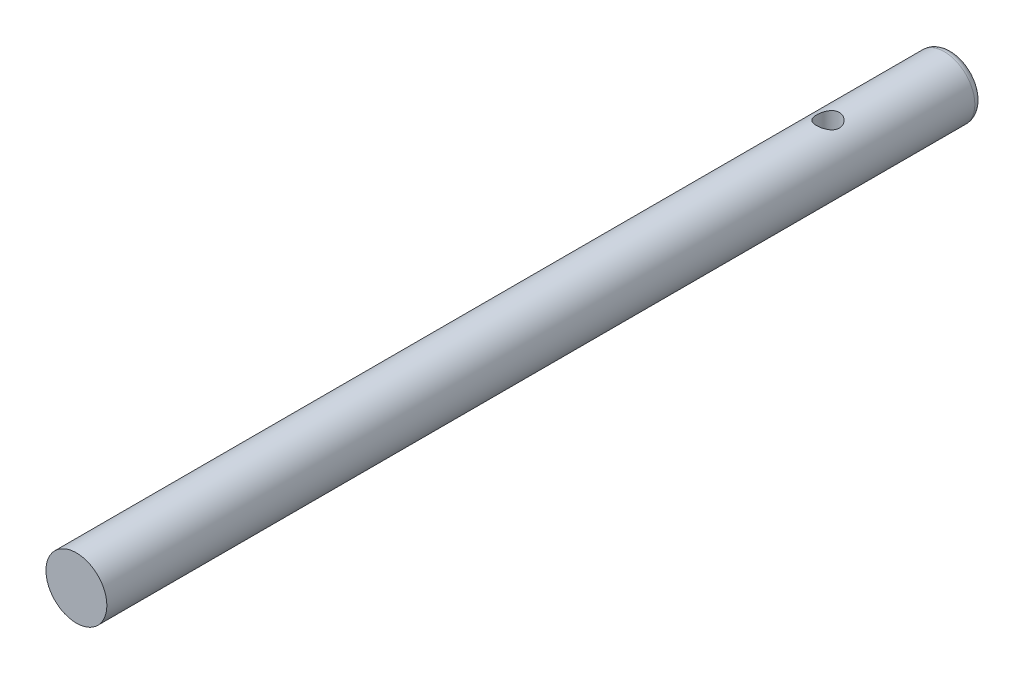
ISO-10303-21;
HEADER;
FILE_DESCRIPTION(('STEP AP214'),'2;1');
FILE_NAME('part.step','',(''),(''),'','','');
FILE_SCHEMA(('AUTOMOTIVE_DESIGN { 1 0 10303 214 1 1 1 1 }'));
ENDSEC;
DATA;
#1=APPLICATION_CONTEXT('core data for automotive mechanical design processes');
#2=APPLICATION_PROTOCOL_DEFINITION('international standard','automotive_design',2000,#1);
#3=PRODUCT_CONTEXT('',#1,'mechanical');
#4=PRODUCT('Part','Part','',(#3));
#5=PRODUCT_RELATED_PRODUCT_CATEGORY('part','',(#4));
#6=PRODUCT_DEFINITION_FORMATION('','',#4);
#7=PRODUCT_DEFINITION_CONTEXT('part definition',#1,'design');
#8=PRODUCT_DEFINITION('design','',#6,#7);
#9=PRODUCT_DEFINITION_SHAPE('','',#8);
#10=(LENGTH_UNIT() NAMED_UNIT(*) SI_UNIT(.MILLI.,.METRE.));
#11=(NAMED_UNIT(*) PLANE_ANGLE_UNIT() SI_UNIT($,.RADIAN.));
#12=(NAMED_UNIT(*) SI_UNIT($,.STERADIAN.) SOLID_ANGLE_UNIT());
#13=UNCERTAINTY_MEASURE_WITH_UNIT(LENGTH_MEASURE(1.E-05),#10,'distance_accuracy_value','');
#14=(GEOMETRIC_REPRESENTATION_CONTEXT(3) GLOBAL_UNCERTAINTY_ASSIGNED_CONTEXT((#13)) GLOBAL_UNIT_ASSIGNED_CONTEXT((#10,
#11,#12)) REPRESENTATION_CONTEXT('',''));
#15=CARTESIAN_POINT('',(0.,0.,0.));
#16=DIRECTION('',(0.,0.,1.));
#17=DIRECTION('',(1.,0.,0.));
#18=AXIS2_PLACEMENT_3D('',#15,#16,#17);
#19=CARTESIAN_POINT('',(0.,0.,115.));
#20=DIRECTION('',(0.,0.,-1.));
#21=DIRECTION('',(-1.,0.,0.));
#22=AXIS2_PLACEMENT_3D('',#19,#20,#21);
#23=CYLINDRICAL_SURFACE('',#22,4.);
#24=CARTESIAN_POINT('',(0.,0.,1.));
#25=DIRECTION('',(0.,0.,1.));
#26=DIRECTION('',(1.,0.,0.));
#27=AXIS2_PLACEMENT_3D('',#24,#25,#26);
#28=CIRCLE('',#27,4.);
#29=CARTESIAN_POINT('',(4.,0.,1.));
#30=VERTEX_POINT('',#29);
#31=EDGE_CURVE('E56',#30,#30,#28,.T.);
#32=ORIENTED_EDGE('',*,*,#31,.T.);
#33=EDGE_LOOP('',(#32));
#34=FACE_BOUND('',#33,.T.);
#35=CARTESIAN_POINT('',(0.,0.,115.));
#36=DIRECTION('',(0.,0.,1.));
#37=DIRECTION('',(1.,0.,0.));
#38=AXIS2_PLACEMENT_3D('',#35,#36,#37);
#39=CIRCLE('',#38,4.);
#40=CARTESIAN_POINT('',(4.,0.,115.));
#41=VERTEX_POINT('',#40);
#42=EDGE_CURVE('E62',#41,#41,#39,.T.);
#43=ORIENTED_EDGE('',*,*,#42,.F.);
#44=EDGE_LOOP('',(#43));
#45=FACE_BOUND('',#44,.T.);
#46=CARTESIAN_POINT('',(0.,-4.,14.8));
#47=CARTESIAN_POINT('',(0.0812350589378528,-4.00000217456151,14.7999970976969));
#48=CARTESIAN_POINT('',(0.162450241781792,-3.99750379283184,14.8066197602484));
#49=CARTESIAN_POINT('',(0.322453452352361,-3.98778696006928,14.8328281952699));
#50=CARTESIAN_POINT('',(0.401241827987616,-3.98056918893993,14.8524121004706));
#51=CARTESIAN_POINT('',(0.554060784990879,-3.96218832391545,14.9037530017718));
#52=CARTESIAN_POINT('',(0.628100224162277,-3.9510328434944,14.9354865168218));
#53=CARTESIAN_POINT('',(0.769799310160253,-3.92588767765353,15.0101064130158));
#54=CARTESIAN_POINT('',(0.837457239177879,-3.91189723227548,15.0529957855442));
#55=CARTESIAN_POINT('',(0.967346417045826,-3.88186246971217,15.1506125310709));
#56=CARTESIAN_POINT('',(1.02927073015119,-3.86576002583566,15.2057302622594));
#57=CARTESIAN_POINT('',(1.14324421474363,-3.83360220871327,15.3254104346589));
#58=CARTESIAN_POINT('',(1.19529036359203,-3.81754685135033,15.3899757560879));
#59=CARTESIAN_POINT('',(1.28998202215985,-3.78662470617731,15.5297174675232));
#60=CARTESIAN_POINT('',(1.3321939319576,-3.77182648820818,15.6052043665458));
#61=CARTESIAN_POINT('',(1.40318646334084,-3.74599860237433,15.7628483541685));
#62=CARTESIAN_POINT('',(1.43197244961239,-3.73496742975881,15.8450027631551));
#63=CARTESIAN_POINT('',(1.47408431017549,-3.71854412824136,16.0101167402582));
#64=CARTESIAN_POINT('',(1.48799593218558,-3.71293924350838,16.0929050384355));
#65=CARTESIAN_POINT('',(1.50179556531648,-3.70738061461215,16.2598161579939));
#66=CARTESIAN_POINT('',(1.50168936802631,-3.70742453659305,16.3439384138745));
#67=CARTESIAN_POINT('',(1.48790429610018,-3.71297511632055,16.505769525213));
#68=CARTESIAN_POINT('',(1.47503808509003,-3.71815468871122,16.5835609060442));
#69=CARTESIAN_POINT('',(1.4374416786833,-3.73284938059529,16.7357871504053));
#70=CARTESIAN_POINT('',(1.41270969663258,-3.74236515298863,16.8102215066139));
#71=CARTESIAN_POINT('',(1.35163748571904,-3.76485702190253,16.9552770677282));
#72=CARTESIAN_POINT('',(1.31508648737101,-3.77789517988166,17.0257994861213));
#73=CARTESIAN_POINT('',(1.23156073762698,-3.80594210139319,17.159945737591));
#74=CARTESIAN_POINT('',(1.18458238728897,-3.82095154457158,17.2235671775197));
#75=CARTESIAN_POINT('',(1.07781780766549,-3.85248038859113,17.3466036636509));
#76=CARTESIAN_POINT('',(1.01738298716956,-3.86903347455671,17.4054486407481));
#77=CARTESIAN_POINT('',(0.887312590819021,-3.90091728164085,17.5123379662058));
#78=CARTESIAN_POINT('',(0.817675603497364,-3.91624781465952,17.5603806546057));
#79=CARTESIAN_POINT('',(0.669723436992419,-3.9442639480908,17.6449303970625));
#80=CARTESIAN_POINT('',(0.591290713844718,-3.95690498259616,17.6812475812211));
#81=CARTESIAN_POINT('',(0.428836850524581,-3.97778718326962,17.73998260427));
#82=CARTESIAN_POINT('',(0.344818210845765,-3.98603030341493,17.7624066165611));
#83=CARTESIAN_POINT('',(0.178375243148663,-3.99684443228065,17.791622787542));
#84=CARTESIAN_POINT('',(0.0961036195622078,-3.99969369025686,17.7991826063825));
#85=CARTESIAN_POINT('',(-0.0685724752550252,-4.00025893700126,17.8006910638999));
#86=CARTESIAN_POINT('',(-0.150976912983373,-3.99797606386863,17.7946427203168));
#87=CARTESIAN_POINT('',(-0.31026204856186,-3.98871709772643,17.7696899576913));
#88=CARTESIAN_POINT('',(-0.387233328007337,-3.98192470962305,17.7512884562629));
#89=CARTESIAN_POINT('',(-0.536941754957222,-3.96451477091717,17.7028139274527));
#90=CARTESIAN_POINT('',(-0.609678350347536,-3.9538967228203,17.672739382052));
#91=CARTESIAN_POINT('',(-0.751247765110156,-3.92949624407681,17.6008135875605));
#92=CARTESIAN_POINT('',(-0.819903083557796,-3.91563000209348,17.5586422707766));
#93=CARTESIAN_POINT('',(-0.949392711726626,-3.88626671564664,17.4640818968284));
#94=CARTESIAN_POINT('',(-1.01022412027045,-3.87076907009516,17.4116890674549));
#95=CARTESIAN_POINT('',(-1.12603079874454,-3.83873329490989,17.2945958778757));
#96=CARTESIAN_POINT('',(-1.18046154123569,-3.82218696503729,17.2293578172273));
#97=CARTESIAN_POINT('',(-1.27771050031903,-3.79078815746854,17.0903486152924));
#98=CARTESIAN_POINT('',(-1.32052767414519,-3.77593583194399,17.0165767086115));
#99=CARTESIAN_POINT('',(-1.39337773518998,-3.74966829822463,16.8619840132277));
#100=CARTESIAN_POINT('',(-1.42335685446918,-3.73826760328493,16.7811352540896));
#101=CARTESIAN_POINT('',(-1.46907883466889,-3.72054032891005,16.6149902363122));
#102=CARTESIAN_POINT('',(-1.48483050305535,-3.71421061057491,16.5296967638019));
#103=CARTESIAN_POINT('',(-1.50086347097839,-3.70775894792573,16.3629838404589));
#104=CARTESIAN_POINT('',(-1.50207331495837,-3.70726444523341,16.2816673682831));
#105=CARTESIAN_POINT('',(-1.49136715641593,-3.71158412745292,16.1200546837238));
#106=CARTESIAN_POINT('',(-1.47945239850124,-3.71639780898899,16.0397583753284));
#107=CARTESIAN_POINT('',(-1.44355815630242,-3.73048141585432,15.8849527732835));
#108=CARTESIAN_POINT('',(-1.41995798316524,-3.73961085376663,15.8103416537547));
#109=CARTESIAN_POINT('',(-1.3616969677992,-3.76121548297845,15.6660944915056));
#110=CARTESIAN_POINT('',(-1.32703332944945,-3.77369151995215,15.5964597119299));
#111=CARTESIAN_POINT('',(-1.24552075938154,-3.80139723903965,15.4601732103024));
#112=CARTESIAN_POINT('',(-1.1981283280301,-3.81673698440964,15.3938692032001));
#113=CARTESIAN_POINT('',(-1.09334485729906,-3.84806246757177,15.2698584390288));
#114=CARTESIAN_POINT('',(-1.03595064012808,-3.86404840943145,15.2121544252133));
#115=CARTESIAN_POINT('',(-0.909080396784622,-3.89590424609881,15.1037980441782));
#116=CARTESIAN_POINT('',(-0.839118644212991,-3.91172104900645,15.0536962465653));
#117=CARTESIAN_POINT('',(-0.69121322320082,-3.94054514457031,14.9659773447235));
#118=CARTESIAN_POINT('',(-0.613268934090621,-3.95355221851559,14.9283612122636));
#119=CARTESIAN_POINT('',(-0.447999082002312,-3.9757429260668,14.8656231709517));
#120=CARTESIAN_POINT('',(-0.360413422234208,-3.98473657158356,14.8411129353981));
#121=CARTESIAN_POINT('',(-0.181875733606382,-3.99686242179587,14.8083070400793));
#122=CARTESIAN_POINT('',(-0.0909254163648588,-3.99999756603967,14.8000032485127));
#123=CARTESIAN_POINT('',(0.,-4.,14.8));
#124=B_SPLINE_CURVE_WITH_KNOTS('',3,(#46,#47,#48,#49,#50,#51,#52,#53,#54,#55,#56,#57,#58,#59,
#60,#61,#62,#63,#64,#65,#66,#67,#68,#69,#70,#71,#72,#73,#74,#75,#76,#77,#78,#79,#80,#81,#82,#83,
#84,#85,#86,#87,#88,#89,#90,#91,#92,#93,#94,#95,#96,#97,#98,#99,#100,#101,#102,#103,#104,#105,
#106,#107,#108,#109,#110,#111,#112,#113,#114,#115,#116,#117,#118,#119,#120,#121,#122,#123),
.UNSPECIFIED.,.T.,.F.,(4,2,2,2,2,2,2,2,2,2,2,2,2,2,2,2,2,2,2,2,2,2,2,2,2,2,2,2,2,2,2,2,2,2,2,2,
2,2,4),(0.,0.24336980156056,0.48670454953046,0.729571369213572,0.97250337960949,
1.22473618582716,1.47704604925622,1.73896674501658,2.00078269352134,2.25185874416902,
2.50283106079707,2.73878345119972,2.97477138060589,3.21522408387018,3.45575990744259,
3.71246153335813,3.96920257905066,4.22991375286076,4.49050899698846,4.73725019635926,
4.98393668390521,5.2211443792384,5.45838293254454,5.702592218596,5.94689180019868,
6.20536519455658,6.46386178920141,6.72343066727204,6.98283874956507,7.22558763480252,
7.46831350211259,7.70363142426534,7.93900886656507,8.18672471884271,8.43451941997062,
8.69572329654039,8.95694749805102,9.22948515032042,9.50188601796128),.UNSPECIFIED.);
#125=CARTESIAN_POINT('',(0.,-4.,14.8));
#126=VERTEX_POINT('',#125);
#127=EDGE_CURVE('E65',#126,#126,#124,.T.);
#128=ORIENTED_EDGE('',*,*,#127,.F.);
#129=EDGE_LOOP('',(#128));
#130=FACE_BOUND('',#129,.T.);
#131=CARTESIAN_POINT('',(0.,4.,14.8));
#132=CARTESIAN_POINT('',(-0.0812350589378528,4.00000217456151,14.7999970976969));
#133=CARTESIAN_POINT('',(-0.162450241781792,3.99750379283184,14.8066197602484));
#134=CARTESIAN_POINT('',(-0.322453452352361,3.98778696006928,14.8328281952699));
#135=CARTESIAN_POINT('',(-0.401241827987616,3.98056918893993,14.8524121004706));
#136=CARTESIAN_POINT('',(-0.554060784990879,3.96218832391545,14.9037530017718));
#137=CARTESIAN_POINT('',(-0.628100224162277,3.9510328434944,14.9354865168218));
#138=CARTESIAN_POINT('',(-0.769799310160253,3.92588767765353,15.0101064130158));
#139=CARTESIAN_POINT('',(-0.837457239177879,3.91189723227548,15.0529957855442));
#140=CARTESIAN_POINT('',(-0.967346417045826,3.88186246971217,15.1506125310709));
#141=CARTESIAN_POINT('',(-1.02927073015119,3.86576002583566,15.2057302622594));
#142=CARTESIAN_POINT('',(-1.14324421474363,3.83360220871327,15.3254104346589));
#143=CARTESIAN_POINT('',(-1.19529036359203,3.81754685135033,15.3899757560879));
#144=CARTESIAN_POINT('',(-1.28998202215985,3.78662470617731,15.5297174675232));
#145=CARTESIAN_POINT('',(-1.3321939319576,3.77182648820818,15.6052043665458));
#146=CARTESIAN_POINT('',(-1.40318646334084,3.74599860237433,15.7628483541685));
#147=CARTESIAN_POINT('',(-1.43197244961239,3.73496742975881,15.8450027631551));
#148=CARTESIAN_POINT('',(-1.47408431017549,3.71854412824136,16.0101167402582));
#149=CARTESIAN_POINT('',(-1.48799593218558,3.71293924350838,16.0929050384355));
#150=CARTESIAN_POINT('',(-1.50179556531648,3.70738061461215,16.2598161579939));
#151=CARTESIAN_POINT('',(-1.50168936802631,3.70742453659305,16.3439384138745));
#152=CARTESIAN_POINT('',(-1.48790429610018,3.71297511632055,16.505769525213));
#153=CARTESIAN_POINT('',(-1.47503808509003,3.71815468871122,16.5835609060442));
#154=CARTESIAN_POINT('',(-1.4374416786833,3.73284938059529,16.7357871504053));
#155=CARTESIAN_POINT('',(-1.41270969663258,3.74236515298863,16.8102215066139));
#156=CARTESIAN_POINT('',(-1.35163748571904,3.76485702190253,16.9552770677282));
#157=CARTESIAN_POINT('',(-1.31508648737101,3.77789517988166,17.0257994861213));
#158=CARTESIAN_POINT('',(-1.23156073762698,3.80594210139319,17.159945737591));
#159=CARTESIAN_POINT('',(-1.18458238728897,3.82095154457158,17.2235671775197));
#160=CARTESIAN_POINT('',(-1.07781780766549,3.85248038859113,17.3466036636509));
#161=CARTESIAN_POINT('',(-1.01738298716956,3.86903347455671,17.4054486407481));
#162=CARTESIAN_POINT('',(-0.887312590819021,3.90091728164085,17.5123379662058));
#163=CARTESIAN_POINT('',(-0.817675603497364,3.91624781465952,17.5603806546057));
#164=CARTESIAN_POINT('',(-0.669723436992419,3.9442639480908,17.6449303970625));
#165=CARTESIAN_POINT('',(-0.591290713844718,3.95690498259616,17.6812475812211));
#166=CARTESIAN_POINT('',(-0.428836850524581,3.97778718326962,17.73998260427));
#167=CARTESIAN_POINT('',(-0.344818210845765,3.98603030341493,17.7624066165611));
#168=CARTESIAN_POINT('',(-0.178375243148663,3.99684443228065,17.791622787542));
#169=CARTESIAN_POINT('',(-0.0961036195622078,3.99969369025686,17.7991826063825));
#170=CARTESIAN_POINT('',(0.0685724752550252,4.00025893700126,17.8006910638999));
#171=CARTESIAN_POINT('',(0.150976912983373,3.99797606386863,17.7946427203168));
#172=CARTESIAN_POINT('',(0.31026204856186,3.98871709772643,17.7696899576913));
#173=CARTESIAN_POINT('',(0.387233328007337,3.98192470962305,17.7512884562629));
#174=CARTESIAN_POINT('',(0.536941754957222,3.96451477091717,17.7028139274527));
#175=CARTESIAN_POINT('',(0.609678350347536,3.9538967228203,17.672739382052));
#176=CARTESIAN_POINT('',(0.751247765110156,3.92949624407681,17.6008135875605));
#177=CARTESIAN_POINT('',(0.819903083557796,3.91563000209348,17.5586422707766));
#178=CARTESIAN_POINT('',(0.949392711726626,3.88626671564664,17.4640818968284));
#179=CARTESIAN_POINT('',(1.01022412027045,3.87076907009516,17.4116890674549));
#180=CARTESIAN_POINT('',(1.12603079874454,3.83873329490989,17.2945958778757));
#181=CARTESIAN_POINT('',(1.18046154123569,3.82218696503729,17.2293578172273));
#182=CARTESIAN_POINT('',(1.27771050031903,3.79078815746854,17.0903486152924));
#183=CARTESIAN_POINT('',(1.32052767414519,3.77593583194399,17.0165767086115));
#184=CARTESIAN_POINT('',(1.39337773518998,3.74966829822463,16.8619840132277));
#185=CARTESIAN_POINT('',(1.42335685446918,3.73826760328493,16.7811352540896));
#186=CARTESIAN_POINT('',(1.46907883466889,3.72054032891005,16.6149902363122));
#187=CARTESIAN_POINT('',(1.48483050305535,3.71421061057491,16.5296967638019));
#188=CARTESIAN_POINT('',(1.50086347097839,3.70775894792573,16.3629838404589));
#189=CARTESIAN_POINT('',(1.50207331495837,3.70726444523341,16.2816673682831));
#190=CARTESIAN_POINT('',(1.49136715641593,3.71158412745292,16.1200546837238));
#191=CARTESIAN_POINT('',(1.47945239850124,3.71639780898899,16.0397583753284));
#192=CARTESIAN_POINT('',(1.44355815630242,3.73048141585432,15.8849527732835));
#193=CARTESIAN_POINT('',(1.41995798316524,3.73961085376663,15.8103416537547));
#194=CARTESIAN_POINT('',(1.3616969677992,3.76121548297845,15.6660944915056));
#195=CARTESIAN_POINT('',(1.32703332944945,3.77369151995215,15.5964597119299));
#196=CARTESIAN_POINT('',(1.24552075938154,3.80139723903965,15.4601732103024));
#197=CARTESIAN_POINT('',(1.1981283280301,3.81673698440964,15.3938692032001));
#198=CARTESIAN_POINT('',(1.09334485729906,3.84806246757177,15.2698584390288));
#199=CARTESIAN_POINT('',(1.03595064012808,3.86404840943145,15.2121544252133));
#200=CARTESIAN_POINT('',(0.909080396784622,3.89590424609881,15.1037980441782));
#201=CARTESIAN_POINT('',(0.839118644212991,3.91172104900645,15.0536962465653));
#202=CARTESIAN_POINT('',(0.69121322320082,3.94054514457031,14.9659773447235));
#203=CARTESIAN_POINT('',(0.613268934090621,3.95355221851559,14.9283612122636));
#204=CARTESIAN_POINT('',(0.447999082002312,3.9757429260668,14.8656231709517));
#205=CARTESIAN_POINT('',(0.360413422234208,3.98473657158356,14.8411129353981));
#206=CARTESIAN_POINT('',(0.181875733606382,3.99686242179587,14.8083070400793));
#207=CARTESIAN_POINT('',(0.0909254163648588,3.99999756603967,14.8000032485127));
#208=CARTESIAN_POINT('',(0.,4.,14.8));
#209=B_SPLINE_CURVE_WITH_KNOTS('',3,(#131,#132,#133,#134,#135,#136,#137,#138,#139,#140,#141,
#142,#143,#144,#145,#146,#147,#148,#149,#150,#151,#152,#153,#154,#155,#156,#157,#158,#159,#160,
#161,#162,#163,#164,#165,#166,#167,#168,#169,#170,#171,#172,#173,#174,#175,#176,#177,#178,#179,
#180,#181,#182,#183,#184,#185,#186,#187,#188,#189,#190,#191,#192,#193,#194,#195,#196,#197,#198,
#199,#200,#201,#202,#203,#204,#205,#206,#207,#208),.UNSPECIFIED.,.T.,.F.,(4,2,2,2,2,2,2,2,2,2,2,
2,2,2,2,2,2,2,2,2,2,2,2,2,2,2,2,2,2,2,2,2,2,2,2,2,2,2,4),(0.,0.24336980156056,0.48670454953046,
0.729571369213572,0.97250337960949,1.22473618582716,1.47704604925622,1.73896674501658,
2.00078269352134,2.25185874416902,2.50283106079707,2.73878345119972,2.97477138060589,
3.21522408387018,3.45575990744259,3.71246153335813,3.96920257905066,4.22991375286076,
4.49050899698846,4.73725019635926,4.98393668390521,5.2211443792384,5.45838293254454,
5.702592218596,5.94689180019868,6.20536519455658,6.46386178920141,6.72343066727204,
6.98283874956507,7.22558763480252,7.46831350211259,7.70363142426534,7.93900886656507,
8.18672471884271,8.43451941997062,8.69572329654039,8.95694749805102,9.22948515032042,
9.50188601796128),.UNSPECIFIED.);
#210=CARTESIAN_POINT('',(0.,4.,14.8));
#211=VERTEX_POINT('',#210);
#212=EDGE_CURVE('E47',#211,#211,#209,.T.);
#213=ORIENTED_EDGE('',*,*,#212,.F.);
#214=EDGE_LOOP('',(#213));
#215=FACE_BOUND('',#214,.T.);
#216=ADVANCED_FACE('F43',(#34,#45,#130,#215),#23,.T.);
#217=CARTESIAN_POINT('',(0.,0.,115.));
#218=DIRECTION('',(0.,0.,1.));
#219=DIRECTION('',(1.,0.,0.));
#220=AXIS2_PLACEMENT_3D('',#217,#218,#219);
#221=PLANE('',#220);
#222=ORIENTED_EDGE('',*,*,#42,.T.);
#223=EDGE_LOOP('',(#222));
#224=FACE_BOUND('',#223,.T.);
#225=ADVANCED_FACE('F78',(#224),#221,.T.);
#226=CARTESIAN_POINT('',(0.,0.,0.));
#227=DIRECTION('',(0.,0.,1.));
#228=DIRECTION('',(1.,0.,0.));
#229=AXIS2_PLACEMENT_3D('',#226,#227,#228);
#230=PLANE('',#229);
#231=CARTESIAN_POINT('',(0.,0.,0.));
#232=DIRECTION('',(0.,0.,1.));
#233=DIRECTION('',(1.,0.,0.));
#234=AXIS2_PLACEMENT_3D('',#231,#232,#233);
#235=CIRCLE('',#234,3.);
#236=CARTESIAN_POINT('',(3.,0.,0.));
#237=VERTEX_POINT('',#236);
#238=EDGE_CURVE('E10',#237,#237,#235,.F.);
#239=ORIENTED_EDGE('',*,*,#238,.T.);
#240=EDGE_LOOP('',(#239));
#241=FACE_BOUND('',#240,.T.);
#242=ADVANCED_FACE('F81',(#241),#230,.F.);
#243=CARTESIAN_POINT('',(0.,0.,1.));
#244=DIRECTION('',(0.,0.,1.));
#245=DIRECTION('',(1.,0.,0.));
#246=AXIS2_PLACEMENT_3D('',#243,#244,#245);
#247=TOROIDAL_SURFACE('',#246,3.,1.);
#248=ORIENTED_EDGE('',*,*,#238,.F.);
#249=EDGE_LOOP('',(#248));
#250=FACE_BOUND('',#249,.T.);
#251=ORIENTED_EDGE('',*,*,#31,.F.);
#252=EDGE_LOOP('',(#251));
#253=FACE_BOUND('',#252,.T.);
#254=ADVANCED_FACE('F45',(#250,#253),#247,.T.);
#255=CARTESIAN_POINT('',(0.,10.,16.3));
#256=DIRECTION('',(0.,-1.,0.));
#257=DIRECTION('',(0.,0.,-1.));
#258=AXIS2_PLACEMENT_3D('',#255,#256,#257);
#259=CYLINDRICAL_SURFACE('',#258,1.5);
#260=ORIENTED_EDGE('',*,*,#127,.T.);
#261=EDGE_LOOP('',(#260));
#262=FACE_BOUND('',#261,.T.);
#263=ORIENTED_EDGE('',*,*,#212,.T.);
#264=EDGE_LOOP('',(#263));
#265=FACE_BOUND('',#264,.T.);
#266=ADVANCED_FACE('F73',(#262,#265),#259,.F.);
#267=CLOSED_SHELL('',(#216,#225,#242,#254,#266));
#268=MANIFOLD_SOLID_BREP('B2',#267);
#269=ADVANCED_BREP_SHAPE_REPRESENTATION('',(#18,#268),#14);
#270=SHAPE_DEFINITION_REPRESENTATION(#9,#269);
ENDSEC;
END-ISO-10303-21;
